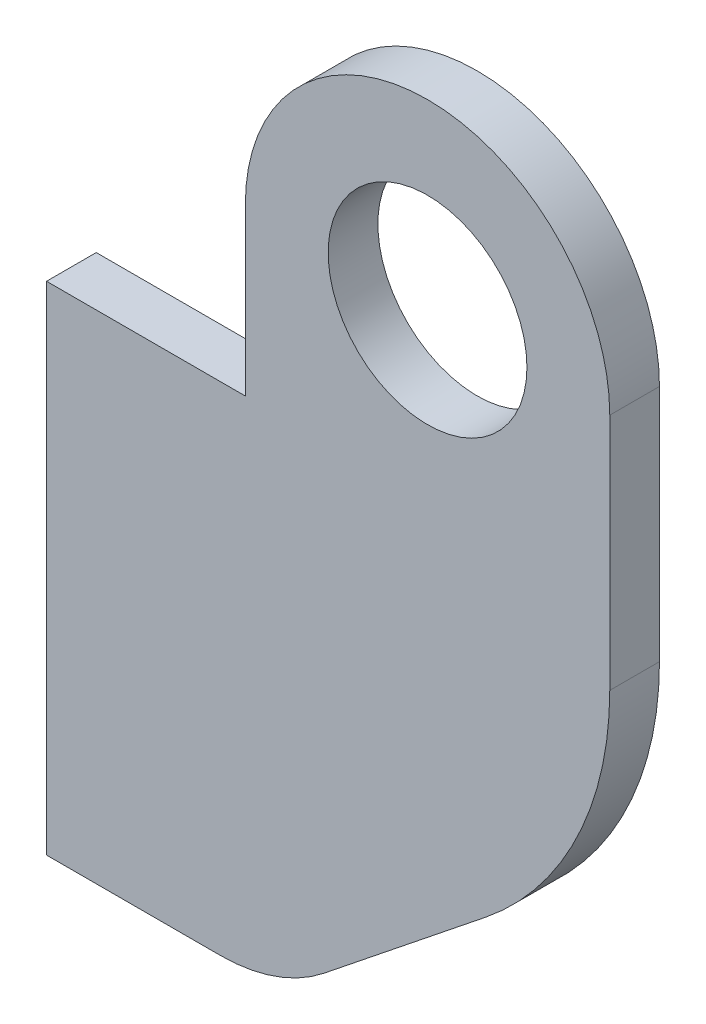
from build123d import *

# Parameters (mm, degrees)
SKETCH1_R           = 30
BOSS_EXTRUDE1_DEPTH = 7.5
FILLET1_R           = 100
FILLET2_R           = 50


with BuildPart() as part:
    # Sketch1 → Boss-Extrude1 (new, symmetric)
    with BuildSketch(Plane.XY):
        with BuildLine():
            Line((0, 0), (0, -150))
            Line((0, -150), (70, -150))
            Line((70, -150), (170, -70))
            Line((170, -70), (170, 50))
            ThreePointArc((170, 50), (115, 105), (60, 50))
            Line((60, 50), (60, 0))
            Line((60, 0), (0, 0))
        make_face()
        with Locations((115, 50)):
            Circle(SKETCH1_R, mode=Mode.SUBTRACT)
    extrude(amount=BOSS_EXTRUDE1_DEPTH, both=True)

    # Fillet1
    fillet1_edges = [part.edges().sort_by_distance(p)[0] for p in [
        (170, -70, 0),
    ]]
    fillet(fillet1_edges, radius=FILLET1_R)

    # Fillet2
    fillet2_edges = [part.edges().sort_by_distance(p)[0] for p in [
        (70, -150, 0),
    ]]
    fillet(fillet2_edges, radius=FILLET2_R)


solid = part.part
